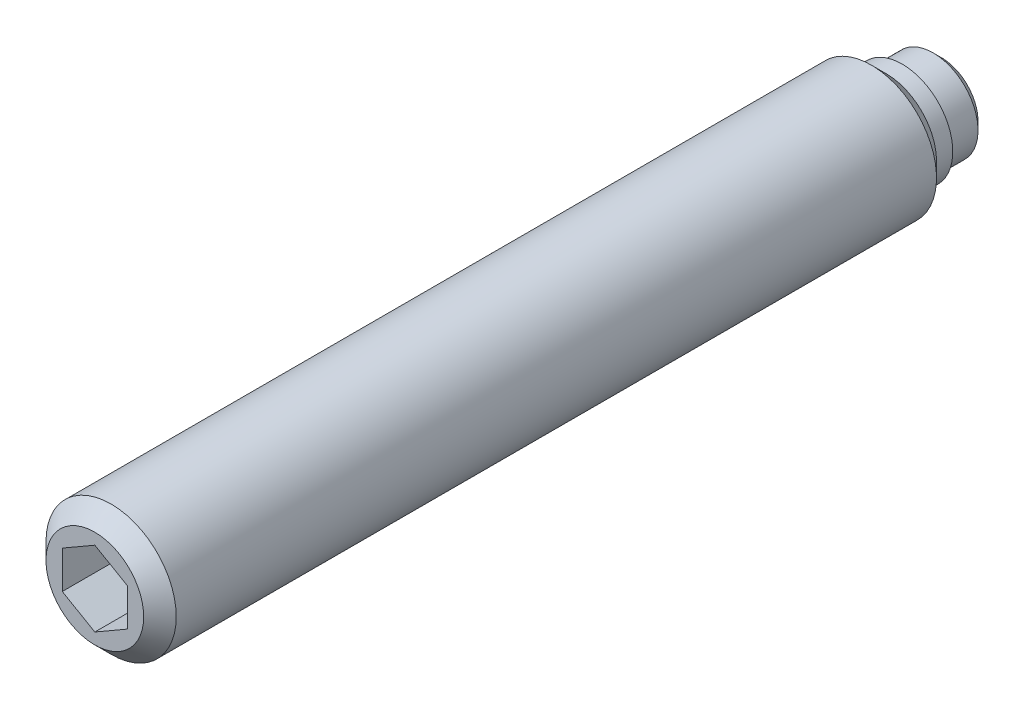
ISO-10303-21;
HEADER;
FILE_DESCRIPTION(('STEP AP214'),'2;1');
FILE_NAME('part.step','',(''),(''),'','','');
FILE_SCHEMA(('AUTOMOTIVE_DESIGN { 1 0 10303 214 1 1 1 1 }'));
ENDSEC;
DATA;
#1=APPLICATION_CONTEXT('core data for automotive mechanical design processes');
#2=APPLICATION_PROTOCOL_DEFINITION('international standard','automotive_design',2000,#1);
#3=PRODUCT_CONTEXT('',#1,'mechanical');
#4=PRODUCT('Part','Part','',(#3));
#5=PRODUCT_RELATED_PRODUCT_CATEGORY('part','',(#4));
#6=PRODUCT_DEFINITION_FORMATION('','',#4);
#7=PRODUCT_DEFINITION_CONTEXT('part definition',#1,'design');
#8=PRODUCT_DEFINITION('design','',#6,#7);
#9=PRODUCT_DEFINITION_SHAPE('','',#8);
#10=(LENGTH_UNIT() NAMED_UNIT(*) SI_UNIT(.MILLI.,.METRE.));
#11=(NAMED_UNIT(*) PLANE_ANGLE_UNIT() SI_UNIT($,.RADIAN.));
#12=(NAMED_UNIT(*) SI_UNIT($,.STERADIAN.) SOLID_ANGLE_UNIT());
#13=UNCERTAINTY_MEASURE_WITH_UNIT(LENGTH_MEASURE(1.E-05),#10,'distance_accuracy_value','');
#14=(GEOMETRIC_REPRESENTATION_CONTEXT(3) GLOBAL_UNCERTAINTY_ASSIGNED_CONTEXT((#13)) GLOBAL_UNIT_ASSIGNED_CONTEXT((#10,
#11,#12)) REPRESENTATION_CONTEXT('',''));
#15=CARTESIAN_POINT('',(0.,0.,0.));
#16=DIRECTION('',(0.,0.,1.));
#17=DIRECTION('',(1.,0.,0.));
#18=AXIS2_PLACEMENT_3D('',#15,#16,#17);
#19=CARTESIAN_POINT('',(0.,0.,2.4));
#20=DIRECTION('',(0.,0.,-1.));
#21=DIRECTION('',(-1.,0.,0.));
#22=AXIS2_PLACEMENT_3D('',#19,#20,#21);
#23=CYLINDRICAL_SURFACE('',#22,4.);
#24=CARTESIAN_POINT('',(0.,0.,4.3));
#25=DIRECTION('',(0.,0.,-1.));
#26=DIRECTION('',(-1.,0.,0.));
#27=AXIS2_PLACEMENT_3D('',#24,#25,#26);
#28=CIRCLE('',#27,4.);
#29=CARTESIAN_POINT('',(-4.,0.,4.3));
#30=VERTEX_POINT('',#29);
#31=EDGE_CURVE('E9',#30,#30,#28,.T.);
#32=ORIENTED_EDGE('',*,*,#31,.F.);
#33=EDGE_LOOP('',(#32));
#34=FACE_BOUND('',#33,.T.);
#35=CARTESIAN_POINT('',(0.,0.,51.));
#36=DIRECTION('',(0.,0.,1.));
#37=DIRECTION('',(1.,0.,0.));
#38=AXIS2_PLACEMENT_3D('',#35,#36,#37);
#39=CIRCLE('',#38,4.);
#40=CARTESIAN_POINT('',(4.,0.,51.));
#41=VERTEX_POINT('',#40);
#42=EDGE_CURVE('E70',#41,#41,#39,.T.);
#43=ORIENTED_EDGE('',*,*,#42,.F.);
#44=EDGE_LOOP('',(#43));
#45=FACE_BOUND('',#44,.T.);
#46=ADVANCED_FACE('F14',(#34,#45),#23,.T.);
#47=CARTESIAN_POINT('',(0.,0.,4.3));
#48=DIRECTION('',(0.,0.,1.));
#49=DIRECTION('',(1.,0.,0.));
#50=AXIS2_PLACEMENT_3D('',#47,#48,#49);
#51=CONICAL_SURFACE('',#50,4.,0.785398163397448);
#52=ORIENTED_EDGE('',*,*,#31,.T.);
#53=EDGE_LOOP('',(#52));
#54=FACE_BOUND('',#53,.T.);
#55=CARTESIAN_POINT('',(0.,0.,3.4));
#56=DIRECTION('',(0.,0.,-1.));
#57=DIRECTION('',(-1.,0.,0.));
#58=AXIS2_PLACEMENT_3D('',#55,#56,#57);
#59=CIRCLE('',#58,3.1);
#60=CARTESIAN_POINT('',(-3.1,0.,3.4));
#61=VERTEX_POINT('',#60);
#62=EDGE_CURVE('E21',#61,#61,#59,.T.);
#63=ORIENTED_EDGE('',*,*,#62,.F.);
#64=EDGE_LOOP('',(#63));
#65=FACE_BOUND('',#64,.T.);
#66=ADVANCED_FACE('F139',(#54,#65),#51,.T.);
#67=CARTESIAN_POINT('',(0.,0.,2.4));
#68=DIRECTION('',(0.,0.,-1.));
#69=DIRECTION('',(-1.,0.,0.));
#70=AXIS2_PLACEMENT_3D('',#67,#68,#69);
#71=CYLINDRICAL_SURFACE('',#70,3.1);
#72=ORIENTED_EDGE('',*,*,#62,.T.);
#73=EDGE_LOOP('',(#72));
#74=FACE_BOUND('',#73,.T.);
#75=CARTESIAN_POINT('',(0.,0.,2.4));
#76=DIRECTION('',(0.,0.,-1.));
#77=DIRECTION('',(-1.,0.,0.));
#78=AXIS2_PLACEMENT_3D('',#75,#76,#77);
#79=CIRCLE('',#78,3.1);
#80=CARTESIAN_POINT('',(-3.1,0.,2.4));
#81=VERTEX_POINT('',#80);
#82=EDGE_CURVE('E131',#81,#81,#79,.T.);
#83=ORIENTED_EDGE('',*,*,#82,.F.);
#84=EDGE_LOOP('',(#83));
#85=FACE_BOUND('',#84,.T.);
#86=ADVANCED_FACE('F136',(#74,#85),#71,.T.);
#87=CARTESIAN_POINT('',(0.,3.1,2.4));
#88=DIRECTION('',(0.,0.,1.));
#89=DIRECTION('',(1.,0.,0.));
#90=AXIS2_PLACEMENT_3D('',#87,#88,#89);
#91=PLANE('',#90);
#92=ORIENTED_EDGE('',*,*,#82,.T.);
#93=EDGE_LOOP('',(#92));
#94=FACE_BOUND('',#93,.T.);
#95=CARTESIAN_POINT('',(0.,0.,2.4));
#96=DIRECTION('',(0.,0.,-1.));
#97=DIRECTION('',(-1.,0.,0.));
#98=AXIS2_PLACEMENT_3D('',#95,#96,#97);
#99=CIRCLE('',#98,2.75);
#100=CARTESIAN_POINT('',(-2.75,0.,2.4));
#101=VERTEX_POINT('',#100);
#102=EDGE_CURVE('E128',#101,#101,#99,.T.);
#103=ORIENTED_EDGE('',*,*,#102,.F.);
#104=EDGE_LOOP('',(#103));
#105=FACE_BOUND('',#104,.T.);
#106=ADVANCED_FACE('F147',(#94,#105),#91,.F.);
#107=CARTESIAN_POINT('',(0.,0.,0.));
#108=DIRECTION('',(0.,0.,-1.));
#109=DIRECTION('',(-1.,0.,0.));
#110=AXIS2_PLACEMENT_3D('',#107,#108,#109);
#111=CYLINDRICAL_SURFACE('',#110,2.75);
#112=CARTESIAN_POINT('',(0.,0.,0.5));
#113=DIRECTION('',(0.,0.,-1.));
#114=DIRECTION('',(-1.,0.,0.));
#115=AXIS2_PLACEMENT_3D('',#112,#113,#114);
#116=CIRCLE('',#115,2.75);
#117=CARTESIAN_POINT('',(-2.75,0.,0.5));
#118=VERTEX_POINT('',#117);
#119=EDGE_CURVE('E125',#118,#118,#116,.T.);
#120=ORIENTED_EDGE('',*,*,#119,.F.);
#121=EDGE_LOOP('',(#120));
#122=FACE_BOUND('',#121,.T.);
#123=ORIENTED_EDGE('',*,*,#102,.T.);
#124=EDGE_LOOP('',(#123));
#125=FACE_BOUND('',#124,.T.);
#126=ADVANCED_FACE('F153',(#122,#125),#111,.T.);
#127=CARTESIAN_POINT('',(0.,0.,0.5));
#128=DIRECTION('',(0.,0.,1.));
#129=DIRECTION('',(1.,0.,0.));
#130=AXIS2_PLACEMENT_3D('',#127,#128,#129);
#131=CONICAL_SURFACE('',#130,2.75,0.785398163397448);
#132=CARTESIAN_POINT('',(0.,0.,0.));
#133=DIRECTION('',(0.,0.,-1.));
#134=DIRECTION('',(-1.,0.,0.));
#135=AXIS2_PLACEMENT_3D('',#132,#133,#134);
#136=CIRCLE('',#135,2.25);
#137=CARTESIAN_POINT('',(-2.25,0.,0.));
#138=VERTEX_POINT('',#137);
#139=EDGE_CURVE('E122',#138,#138,#136,.T.);
#140=ORIENTED_EDGE('',*,*,#139,.F.);
#141=EDGE_LOOP('',(#140));
#142=FACE_BOUND('',#141,.T.);
#143=ORIENTED_EDGE('',*,*,#119,.T.);
#144=EDGE_LOOP('',(#143));
#145=FACE_BOUND('',#144,.T.);
#146=ADVANCED_FACE('F157',(#142,#145),#131,.T.);
#147=CARTESIAN_POINT('',(0.,2.25,0.));
#148=DIRECTION('',(0.,0.,1.));
#149=DIRECTION('',(1.,0.,0.));
#150=AXIS2_PLACEMENT_3D('',#147,#148,#149);
#151=PLANE('',#150);
#152=ORIENTED_EDGE('',*,*,#139,.T.);
#153=EDGE_LOOP('',(#152));
#154=FACE_BOUND('',#153,.T.);
#155=ADVANCED_FACE('F161',(#154),#151,.F.);
#156=CARTESIAN_POINT('',(0.,0.,52.));
#157=DIRECTION('',(0.,0.,1.));
#158=DIRECTION('',(1.,0.,0.));
#159=AXIS2_PLACEMENT_3D('',#156,#157,#158);
#160=PLANE('',#159);
#161=DIRECTION('',(0.866025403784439,-0.5,0.));
#162=VECTOR('',#161,1.);
#163=CARTESIAN_POINT('',(-2.,-1.15470053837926,52.));
#164=LINE('',#163,#162);
#165=CARTESIAN_POINT('',(-2.,-1.15470053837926,52.));
#166=VERTEX_POINT('',#165);
#167=CARTESIAN_POINT('',(0.,-2.30940107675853,52.));
#168=VERTEX_POINT('',#167);
#169=EDGE_CURVE('E28',#166,#168,#164,.T.);
#170=ORIENTED_EDGE('',*,*,#169,.F.);
#171=DIRECTION('',(0.,-1.,0.));
#172=VECTOR('',#171,1.);
#173=CARTESIAN_POINT('',(-2.,1.15470053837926,52.));
#174=LINE('',#173,#172);
#175=CARTESIAN_POINT('',(-2.,1.15470053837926,52.));
#176=VERTEX_POINT('',#175);
#177=EDGE_CURVE('E69',#176,#166,#174,.T.);
#178=ORIENTED_EDGE('',*,*,#177,.F.);
#179=DIRECTION('',(-0.866025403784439,-0.5,0.));
#180=VECTOR('',#179,1.);
#181=CARTESIAN_POINT('',(0.,2.30940107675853,52.));
#182=LINE('',#181,#180);
#183=CARTESIAN_POINT('',(0.,2.30940107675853,52.));
#184=VERTEX_POINT('',#183);
#185=EDGE_CURVE('E105',#184,#176,#182,.T.);
#186=ORIENTED_EDGE('',*,*,#185,.F.);
#187=DIRECTION('',(-0.866025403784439,0.5,0.));
#188=VECTOR('',#187,1.);
#189=CARTESIAN_POINT('',(2.,1.15470053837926,52.));
#190=LINE('',#189,#188);
#191=CARTESIAN_POINT('',(2.,1.15470053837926,52.));
#192=VERTEX_POINT('',#191);
#193=EDGE_CURVE('E102',#192,#184,#190,.T.);
#194=ORIENTED_EDGE('',*,*,#193,.F.);
#195=DIRECTION('',(0.,1.,0.));
#196=VECTOR('',#195,1.);
#197=CARTESIAN_POINT('',(2.,-1.15470053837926,52.));
#198=LINE('',#197,#196);
#199=CARTESIAN_POINT('',(2.,-1.15470053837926,52.));
#200=VERTEX_POINT('',#199);
#201=EDGE_CURVE('E99',#200,#192,#198,.T.);
#202=ORIENTED_EDGE('',*,*,#201,.F.);
#203=DIRECTION('',(0.866025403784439,0.5,0.));
#204=VECTOR('',#203,1.);
#205=CARTESIAN_POINT('',(0.,-2.30940107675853,52.));
#206=LINE('',#205,#204);
#207=EDGE_CURVE('E96',#168,#200,#206,.T.);
#208=ORIENTED_EDGE('',*,*,#207,.F.);
#209=EDGE_LOOP('',(#170,#178,#186,#194,#202,#208));
#210=FACE_BOUND('',#209,.T.);
#211=CARTESIAN_POINT('',(0.,0.,52.));
#212=DIRECTION('',(0.,0.,1.));
#213=DIRECTION('',(1.,0.,0.));
#214=AXIS2_PLACEMENT_3D('',#211,#212,#213);
#215=CIRCLE('',#214,3.);
#216=CARTESIAN_POINT('',(3.,0.,52.));
#217=VERTEX_POINT('',#216);
#218=EDGE_CURVE('E119',#217,#217,#215,.T.);
#219=ORIENTED_EDGE('',*,*,#218,.T.);
#220=EDGE_LOOP('',(#219));
#221=FACE_BOUND('',#220,.T.);
#222=ADVANCED_FACE('F165',(#210,#221),#160,.T.);
#223=CARTESIAN_POINT('',(0.,0.,52.));
#224=DIRECTION('',(0.,0.,-1.));
#225=DIRECTION('',(-1.,0.,0.));
#226=AXIS2_PLACEMENT_3D('',#223,#224,#225);
#227=CONICAL_SURFACE('',#226,3.,0.785398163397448);
#228=ORIENTED_EDGE('',*,*,#42,.T.);
#229=EDGE_LOOP('',(#228));
#230=FACE_BOUND('',#229,.T.);
#231=ORIENTED_EDGE('',*,*,#218,.F.);
#232=EDGE_LOOP('',(#231));
#233=FACE_BOUND('',#232,.T.);
#234=ADVANCED_FACE('F169',(#230,#233),#227,.T.);
#235=CARTESIAN_POINT('',(-2.,-1.15470053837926,49.));
#236=DIRECTION('',(-0.5,-0.866025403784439,0.));
#237=DIRECTION('',(0.866025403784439,-0.5,0.));
#238=AXIS2_PLACEMENT_3D('',#235,#236,#237);
#239=PLANE('',#238);
#240=ORIENTED_EDGE('',*,*,#169,.T.);
#241=DIRECTION('',(0.,0.,1.));
#242=VECTOR('',#241,1.);
#243=CARTESIAN_POINT('',(0.,-2.30940107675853,49.));
#244=LINE('',#243,#242);
#245=CARTESIAN_POINT('',(0.,-2.30940107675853,47.));
#246=VERTEX_POINT('',#245);
#247=EDGE_CURVE('E76',#246,#168,#244,.T.);
#248=ORIENTED_EDGE('',*,*,#247,.F.);
#249=DIRECTION('',(0.866025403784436,-0.5,0.));
#250=VECTOR('',#249,1.);
#251=CARTESIAN_POINT('',(-2.,-1.15470053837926,47.));
#252=LINE('',#251,#250);
#253=CARTESIAN_POINT('',(-2.,-1.15470053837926,47.));
#254=VERTEX_POINT('',#253);
#255=EDGE_CURVE('E74',#254,#246,#252,.T.);
#256=ORIENTED_EDGE('',*,*,#255,.F.);
#257=DIRECTION('',(0.,0.,1.));
#258=VECTOR('',#257,1.);
#259=CARTESIAN_POINT('',(-2.,-1.15470053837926,49.));
#260=LINE('',#259,#258);
#261=EDGE_CURVE('E33',#254,#166,#260,.T.);
#262=ORIENTED_EDGE('',*,*,#261,.T.);
#263=EDGE_LOOP('',(#240,#248,#256,#262));
#264=FACE_BOUND('',#263,.T.);
#265=ADVANCED_FACE('F75',(#264),#239,.F.);
#266=CARTESIAN_POINT('',(-2.,1.15470053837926,49.));
#267=DIRECTION('',(-1.,0.,0.));
#268=DIRECTION('',(0.,0.,1.));
#269=AXIS2_PLACEMENT_3D('',#266,#267,#268);
#270=PLANE('',#269);
#271=ORIENTED_EDGE('',*,*,#177,.T.);
#272=ORIENTED_EDGE('',*,*,#261,.F.);
#273=DIRECTION('',(0.,-1.,0.));
#274=VECTOR('',#273,1.);
#275=CARTESIAN_POINT('',(-2.,1.15470053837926,47.));
#276=LINE('',#275,#274);
#277=CARTESIAN_POINT('',(-2.,1.15470053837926,47.));
#278=VERTEX_POINT('',#277);
#279=EDGE_CURVE('E66',#278,#254,#276,.T.);
#280=ORIENTED_EDGE('',*,*,#279,.F.);
#281=DIRECTION('',(0.,0.,1.));
#282=VECTOR('',#281,1.);
#283=CARTESIAN_POINT('',(-2.,1.15470053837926,49.));
#284=LINE('',#283,#282);
#285=EDGE_CURVE('E71',#278,#176,#284,.T.);
#286=ORIENTED_EDGE('',*,*,#285,.T.);
#287=EDGE_LOOP('',(#271,#272,#280,#286));
#288=FACE_BOUND('',#287,.T.);
#289=ADVANCED_FACE('F64',(#288),#270,.F.);
#290=CARTESIAN_POINT('',(0.,2.30940107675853,49.));
#291=DIRECTION('',(-0.5,0.866025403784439,0.));
#292=DIRECTION('',(-0.866025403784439,-0.5,0.));
#293=AXIS2_PLACEMENT_3D('',#290,#291,#292);
#294=PLANE('',#293);
#295=ORIENTED_EDGE('',*,*,#185,.T.);
#296=ORIENTED_EDGE('',*,*,#285,.F.);
#297=DIRECTION('',(-0.866025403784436,-0.5,0.));
#298=VECTOR('',#297,1.);
#299=CARTESIAN_POINT('',(0.,2.30940107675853,47.));
#300=LINE('',#299,#298);
#301=CARTESIAN_POINT('',(0.,2.30940107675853,47.));
#302=VERTEX_POINT('',#301);
#303=EDGE_CURVE('E85',#302,#278,#300,.T.);
#304=ORIENTED_EDGE('',*,*,#303,.F.);
#305=DIRECTION('',(0.,0.,1.));
#306=VECTOR('',#305,1.);
#307=CARTESIAN_POINT('',(0.,2.30940107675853,49.));
#308=LINE('',#307,#306);
#309=EDGE_CURVE('E110',#302,#184,#308,.T.);
#310=ORIENTED_EDGE('',*,*,#309,.T.);
#311=EDGE_LOOP('',(#295,#296,#304,#310));
#312=FACE_BOUND('',#311,.T.);
#313=ADVANCED_FACE('F187',(#312),#294,.F.);
#314=CARTESIAN_POINT('',(2.,1.15470053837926,49.));
#315=DIRECTION('',(0.5,0.866025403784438,0.));
#316=DIRECTION('',(-0.866025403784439,0.5,0.));
#317=AXIS2_PLACEMENT_3D('',#314,#315,#316);
#318=PLANE('',#317);
#319=ORIENTED_EDGE('',*,*,#193,.T.);
#320=ORIENTED_EDGE('',*,*,#309,.F.);
#321=DIRECTION('',(-0.866025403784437,0.5,0.));
#322=VECTOR('',#321,1.);
#323=CARTESIAN_POINT('',(2.,1.15470053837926,47.));
#324=LINE('',#323,#322);
#325=CARTESIAN_POINT('',(2.,1.15470053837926,47.));
#326=VERTEX_POINT('',#325);
#327=EDGE_CURVE('E92',#326,#302,#324,.T.);
#328=ORIENTED_EDGE('',*,*,#327,.F.);
#329=DIRECTION('',(0.,0.,1.));
#330=VECTOR('',#329,1.);
#331=CARTESIAN_POINT('',(2.,1.15470053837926,49.));
#332=LINE('',#331,#330);
#333=EDGE_CURVE('E112',#326,#192,#332,.T.);
#334=ORIENTED_EDGE('',*,*,#333,.T.);
#335=EDGE_LOOP('',(#319,#320,#328,#334));
#336=FACE_BOUND('',#335,.T.);
#337=ADVANCED_FACE('F183',(#336),#318,.F.);
#338=CARTESIAN_POINT('',(2.,-1.15470053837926,49.));
#339=DIRECTION('',(1.,0.,0.));
#340=DIRECTION('',(0.,0.,-1.));
#341=AXIS2_PLACEMENT_3D('',#338,#339,#340);
#342=PLANE('',#341);
#343=ORIENTED_EDGE('',*,*,#201,.T.);
#344=ORIENTED_EDGE('',*,*,#333,.F.);
#345=DIRECTION('',(0.,1.,0.));
#346=VECTOR('',#345,1.);
#347=CARTESIAN_POINT('',(2.,-1.15470053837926,47.));
#348=LINE('',#347,#346);
#349=CARTESIAN_POINT('',(2.,-1.15470053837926,47.));
#350=VERTEX_POINT('',#349);
#351=EDGE_CURVE('E89',#350,#326,#348,.T.);
#352=ORIENTED_EDGE('',*,*,#351,.F.);
#353=DIRECTION('',(0.,0.,1.));
#354=VECTOR('',#353,1.);
#355=CARTESIAN_POINT('',(2.,-1.15470053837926,49.));
#356=LINE('',#355,#354);
#357=EDGE_CURVE('E114',#350,#200,#356,.T.);
#358=ORIENTED_EDGE('',*,*,#357,.T.);
#359=EDGE_LOOP('',(#343,#344,#352,#358));
#360=FACE_BOUND('',#359,.T.);
#361=ADVANCED_FACE('F179',(#360),#342,.F.);
#362=CARTESIAN_POINT('',(0.,-2.30940107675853,49.));
#363=DIRECTION('',(0.5,-0.866025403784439,0.));
#364=DIRECTION('',(0.866025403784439,0.5,0.));
#365=AXIS2_PLACEMENT_3D('',#362,#363,#364);
#366=PLANE('',#365);
#367=ORIENTED_EDGE('',*,*,#207,.T.);
#368=ORIENTED_EDGE('',*,*,#357,.F.);
#369=DIRECTION('',(0.866025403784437,0.5,0.));
#370=VECTOR('',#369,1.);
#371=CARTESIAN_POINT('',(0.,-2.30940107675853,47.));
#372=LINE('',#371,#370);
#373=EDGE_CURVE('E80',#246,#350,#372,.T.);
#374=ORIENTED_EDGE('',*,*,#373,.F.);
#375=ORIENTED_EDGE('',*,*,#247,.T.);
#376=EDGE_LOOP('',(#367,#368,#374,#375));
#377=FACE_BOUND('',#376,.T.);
#378=ADVANCED_FACE('F176',(#377),#366,.F.);
#379=CARTESIAN_POINT('',(0.,0.,47.));
#380=DIRECTION('',(0.,0.,1.));
#381=DIRECTION('',(1.,0.,0.));
#382=AXIS2_PLACEMENT_3D('',#379,#380,#381);
#383=PLANE('',#382);
#384=ORIENTED_EDGE('',*,*,#279,.T.);
#385=ORIENTED_EDGE('',*,*,#255,.T.);
#386=ORIENTED_EDGE('',*,*,#373,.T.);
#387=ORIENTED_EDGE('',*,*,#351,.T.);
#388=ORIENTED_EDGE('',*,*,#327,.T.);
#389=ORIENTED_EDGE('',*,*,#303,.T.);
#390=EDGE_LOOP('',(#384,#385,#386,#387,#388,#389));
#391=FACE_BOUND('',#390,.T.);
#392=ADVANCED_FACE('F82',(#391),#383,.T.);
#393=CLOSED_SHELL('',(#46,#66,#86,#106,#126,#146,#155,#222,#234,#265,#289,#313,#337,#361,#378,#392));
#394=MANIFOLD_SOLID_BREP('B1',#393);
#395=ADVANCED_BREP_SHAPE_REPRESENTATION('',(#18,#394),#14);
#396=SHAPE_DEFINITION_REPRESENTATION(#9,#395);
ENDSEC;
END-ISO-10303-21;
